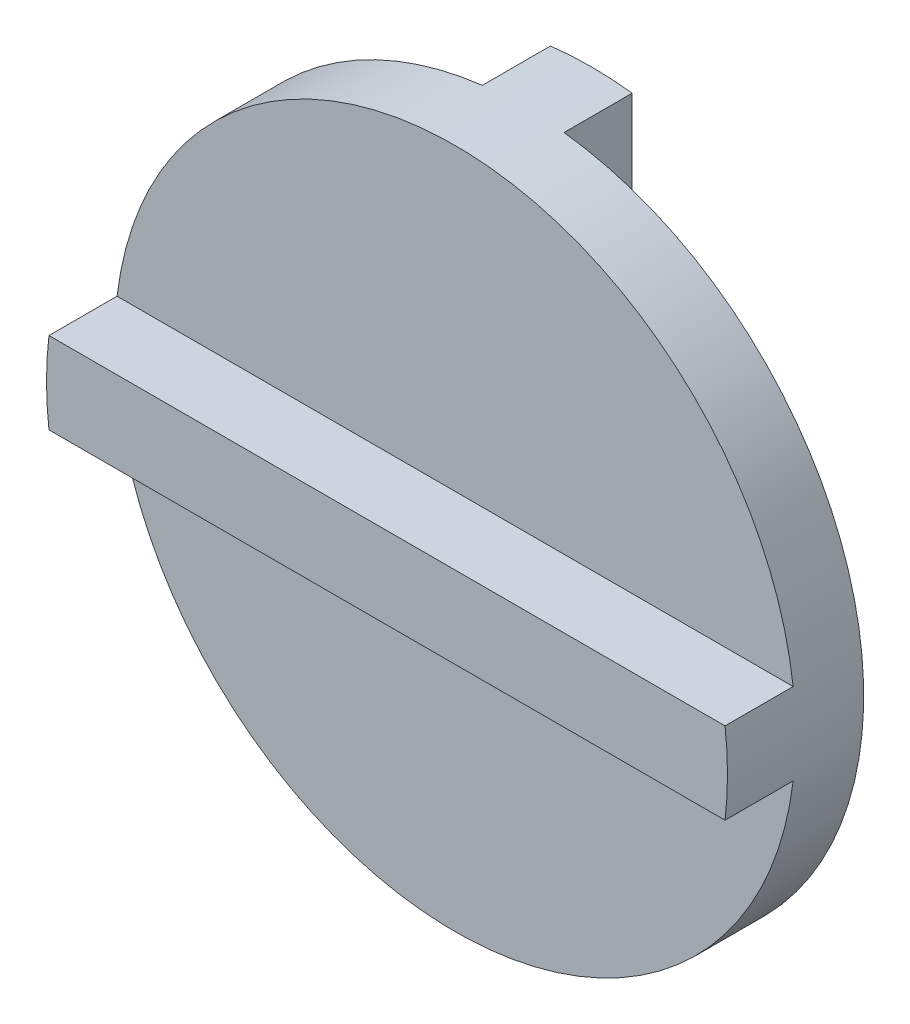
from build123d import *
from build123d.topology import SkipClean

# Parameters (mm, degrees)
SKETCH1_R           = 50
BOSS_EXTRUDE1_DEPTH = 10
BOSS_EXTRUDE2_DEPTH = 10
BOSS_EXTRUDE3_START = 10
BOSS_EXTRUDE3_DEPTH = 10


with BuildPart() as part:
    # Sketch1 → Boss-Extrude1 (new body)
    with BuildSketch(Plane.XY):
        Circle(SKETCH1_R)
    extrude(amount=BOSS_EXTRUDE1_DEPTH)

    # Sketch2 → Boss-Extrude2 (add)
    with SkipClean():  # the faces are left unmerged after this step: merging them gives an invalid solid
        with BuildSketch(Plane.XY.offset(10)):
            with BuildLine():
                Line((-49.638694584, 6), (49.638694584, 6))
                ThreePointArc((49.638694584, 6), (50, 0), (49.638694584, -6))
                Line((49.638694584, -6), (-49.638694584, -6))
                ThreePointArc((-49.638694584, -6), (-50, 0), (-49.638694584, 6))
            make_face()
        extrude(amount=BOSS_EXTRUDE2_DEPTH)

    # Sketch3 → Boss-Extrude3 (add)
    with SkipClean():  # the faces are left unmerged after this step: merging them gives an invalid solid
        with BuildSketch(Plane(origin=(0, 0, 0), x_dir=(-1, 0, 0), z_dir=(0, 0, -1)).offset(BOSS_EXTRUDE3_START)):
            with BuildLine():
                Line((-6, 49.638694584), (-6, -49.638694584))
                ThreePointArc((-6, -49.638694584), (0, -50), (6, -49.638694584))
                Line((6, -49.638694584), (6, 49.638694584))
                ThreePointArc((6, 49.638694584), (0, 50), (-6, 49.638694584))
            make_face()
        extrude(amount=-BOSS_EXTRUDE3_DEPTH)


solid = part.part
